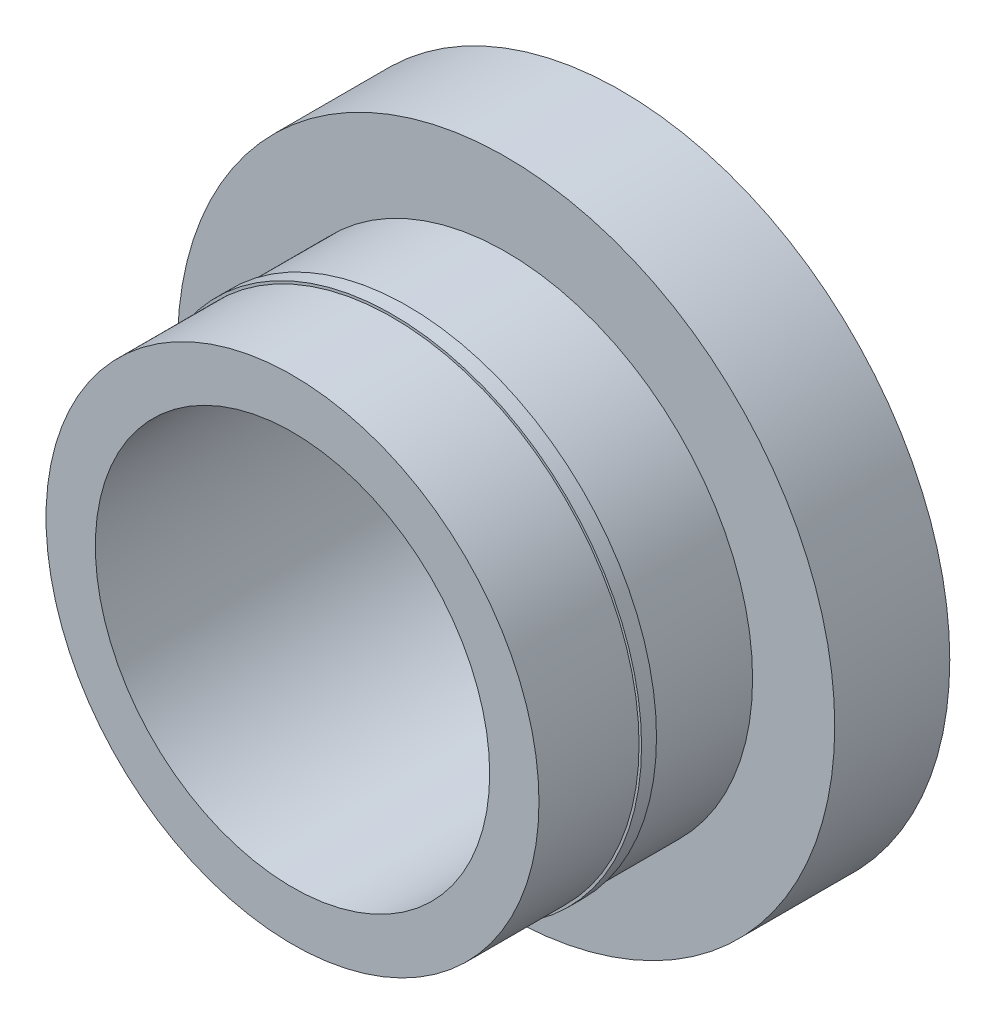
ISO-10303-21;
HEADER;
FILE_DESCRIPTION(('STEP AP214'),'2;1');
FILE_NAME('part.step','',(''),(''),'','','');
FILE_SCHEMA(('AUTOMOTIVE_DESIGN { 1 0 10303 214 1 1 1 1 }'));
ENDSEC;
DATA;
#1=APPLICATION_CONTEXT('core data for automotive mechanical design processes');
#2=APPLICATION_PROTOCOL_DEFINITION('international standard','automotive_design',2000,#1);
#3=PRODUCT_CONTEXT('',#1,'mechanical');
#4=PRODUCT('Part','Part','',(#3));
#5=PRODUCT_RELATED_PRODUCT_CATEGORY('part','',(#4));
#6=PRODUCT_DEFINITION_FORMATION('','',#4);
#7=PRODUCT_DEFINITION_CONTEXT('part definition',#1,'design');
#8=PRODUCT_DEFINITION('design','',#6,#7);
#9=PRODUCT_DEFINITION_SHAPE('','',#8);
#10=(LENGTH_UNIT() NAMED_UNIT(*) SI_UNIT(.MILLI.,.METRE.));
#11=(NAMED_UNIT(*) PLANE_ANGLE_UNIT() SI_UNIT($,.RADIAN.));
#12=(NAMED_UNIT(*) SI_UNIT($,.STERADIAN.) SOLID_ANGLE_UNIT());
#13=UNCERTAINTY_MEASURE_WITH_UNIT(LENGTH_MEASURE(1.E-05),#10,'distance_accuracy_value','');
#14=(GEOMETRIC_REPRESENTATION_CONTEXT(3) GLOBAL_UNCERTAINTY_ASSIGNED_CONTEXT((#13)) GLOBAL_UNIT_ASSIGNED_CONTEXT((#10,
#11,#12)) REPRESENTATION_CONTEXT('',''));
#15=CARTESIAN_POINT('',(0.,0.,0.));
#16=DIRECTION('',(0.,0.,1.));
#17=DIRECTION('',(1.,0.,0.));
#18=AXIS2_PLACEMENT_3D('',#15,#16,#17);
#19=CARTESIAN_POINT('',(180.571520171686,203.348814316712,198.922008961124));
#20=DIRECTION('',(0.,0.,-1.));
#21=DIRECTION('',(1.,0.,0.));
#22=AXIS2_PLACEMENT_3D('',#19,#20,#21);
#23=CYLINDRICAL_SURFACE('',#22,7.50000000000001);
#24=CARTESIAN_POINT('',(180.571520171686,203.348814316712,222.724362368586));
#25=DIRECTION('',(0.,0.,1.));
#26=DIRECTION('',(1.,0.,0.));
#27=AXIS2_PLACEMENT_3D('',#24,#25,#26);
#28=CIRCLE('',#27,7.50000000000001);
#29=CARTESIAN_POINT('',(188.071520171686,203.348814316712,222.724362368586));
#30=VERTEX_POINT('',#29);
#31=EDGE_CURVE('E71',#30,#30,#28,.T.);
#32=ORIENTED_EDGE('',*,*,#31,.F.);
#33=EDGE_LOOP('',(#32));
#34=FACE_BOUND('',#33,.T.);
#35=CARTESIAN_POINT('',(180.571520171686,203.348814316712,219.679241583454));
#36=DIRECTION('',(0.,0.,1.));
#37=DIRECTION('',(1.,0.,0.));
#38=AXIS2_PLACEMENT_3D('',#35,#36,#37);
#39=CIRCLE('',#38,7.50000000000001);
#40=CARTESIAN_POINT('',(188.071520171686,203.348814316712,219.679241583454));
#41=VERTEX_POINT('',#40);
#42=EDGE_CURVE('E10',#41,#41,#39,.T.);
#43=ORIENTED_EDGE('',*,*,#42,.T.);
#44=EDGE_LOOP('',(#43));
#45=FACE_BOUND('',#44,.T.);
#46=ADVANCED_FACE('F37',(#34,#45),#23,.T.);
#47=CARTESIAN_POINT('',(180.571520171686,175.348814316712,219.679241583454));
#48=DIRECTION('',(0.,0.,1.));
#49=DIRECTION('',(-1.,0.,0.));
#50=AXIS2_PLACEMENT_3D('',#47,#48,#49);
#51=PLANE('',#50);
#52=ORIENTED_EDGE('',*,*,#42,.F.);
#53=EDGE_LOOP('',(#52));
#54=FACE_BOUND('',#53,.T.);
#55=CARTESIAN_POINT('',(180.571520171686,203.348814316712,219.679241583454));
#56=DIRECTION('',(0.,0.,1.));
#57=DIRECTION('',(1.,0.,0.));
#58=AXIS2_PLACEMENT_3D('',#55,#56,#57);
#59=CIRCLE('',#58,7.57599598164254);
#60=CARTESIAN_POINT('',(188.147516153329,203.348814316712,219.679241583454));
#61=VERTEX_POINT('',#60);
#62=EDGE_CURVE('E43',#61,#61,#59,.T.);
#63=ORIENTED_EDGE('',*,*,#62,.T.);
#64=EDGE_LOOP('',(#63));
#65=FACE_BOUND('',#64,.T.);
#66=ADVANCED_FACE('F78',(#54,#65),#51,.T.);
#67=CARTESIAN_POINT('',(180.571520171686,203.348814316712,198.922008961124));
#68=DIRECTION('',(0.,0.,-1.));
#69=DIRECTION('',(1.,0.,0.));
#70=AXIS2_PLACEMENT_3D('',#67,#68,#69);
#71=CYLINDRICAL_SURFACE('',#70,7.57599598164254);
#72=ORIENTED_EDGE('',*,*,#62,.F.);
#73=EDGE_LOOP('',(#72));
#74=FACE_BOUND('',#73,.T.);
#75=CARTESIAN_POINT('',(180.571520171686,203.348814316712,219.224362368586));
#76=DIRECTION('',(0.,0.,1.));
#77=DIRECTION('',(1.,0.,0.));
#78=AXIS2_PLACEMENT_3D('',#75,#76,#77);
#79=CIRCLE('',#78,7.57599598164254);
#80=CARTESIAN_POINT('',(188.147516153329,203.348814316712,219.224362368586));
#81=VERTEX_POINT('',#80);
#82=EDGE_CURVE('E47',#81,#81,#79,.T.);
#83=ORIENTED_EDGE('',*,*,#82,.T.);
#84=EDGE_LOOP('',(#83));
#85=FACE_BOUND('',#84,.T.);
#86=ADVANCED_FACE('F82',(#74,#85),#71,.T.);
#87=CARTESIAN_POINT('',(180.571520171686,175.348814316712,219.224362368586));
#88=DIRECTION('',(0.,0.,1.));
#89=DIRECTION('',(-1.,0.,0.));
#90=AXIS2_PLACEMENT_3D('',#87,#88,#89);
#91=PLANE('',#90);
#92=CARTESIAN_POINT('',(180.571520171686,203.348814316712,219.224362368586));
#93=DIRECTION('',(0.,0.,1.));
#94=DIRECTION('',(1.,0.,0.));
#95=AXIS2_PLACEMENT_3D('',#92,#93,#94);
#96=CIRCLE('',#95,7.50000000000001);
#97=CARTESIAN_POINT('',(188.071520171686,203.348814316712,219.224362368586));
#98=VERTEX_POINT('',#97);
#99=EDGE_CURVE('E51',#98,#98,#96,.T.);
#100=ORIENTED_EDGE('',*,*,#99,.T.);
#101=EDGE_LOOP('',(#100));
#102=FACE_BOUND('',#101,.T.);
#103=ORIENTED_EDGE('',*,*,#82,.F.);
#104=EDGE_LOOP('',(#103));
#105=FACE_BOUND('',#104,.T.);
#106=ADVANCED_FACE('F87',(#102,#105),#91,.F.);
#107=CARTESIAN_POINT('',(180.571520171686,203.348814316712,198.922008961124));
#108=DIRECTION('',(0.,0.,-1.));
#109=DIRECTION('',(1.,0.,0.));
#110=AXIS2_PLACEMENT_3D('',#107,#108,#109);
#111=CYLINDRICAL_SURFACE('',#110,7.50000000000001);
#112=CARTESIAN_POINT('',(180.571520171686,203.348814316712,216.224362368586));
#113=DIRECTION('',(0.,0.,1.));
#114=DIRECTION('',(1.,0.,0.));
#115=AXIS2_PLACEMENT_3D('',#112,#113,#114);
#116=CIRCLE('',#115,7.50000000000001);
#117=CARTESIAN_POINT('',(188.071520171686,203.348814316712,216.224362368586));
#118=VERTEX_POINT('',#117);
#119=EDGE_CURVE('E56',#118,#118,#116,.T.);
#120=ORIENTED_EDGE('',*,*,#119,.T.);
#121=EDGE_LOOP('',(#120));
#122=FACE_BOUND('',#121,.T.);
#123=ORIENTED_EDGE('',*,*,#99,.F.);
#124=EDGE_LOOP('',(#123));
#125=FACE_BOUND('',#124,.T.);
#126=ADVANCED_FACE('F93',(#122,#125),#111,.T.);
#127=CARTESIAN_POINT('',(180.571520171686,175.348814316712,216.224362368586));
#128=DIRECTION('',(0.,0.,-1.));
#129=DIRECTION('',(1.,0.,0.));
#130=AXIS2_PLACEMENT_3D('',#127,#128,#129);
#131=PLANE('',#130);
#132=CARTESIAN_POINT('',(180.571520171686,203.348814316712,216.224362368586));
#133=DIRECTION('',(0.,0.,1.));
#134=DIRECTION('',(1.,0.,0.));
#135=AXIS2_PLACEMENT_3D('',#132,#133,#134);
#136=CIRCLE('',#135,10.);
#137=CARTESIAN_POINT('',(190.571520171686,203.348814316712,216.224362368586));
#138=VERTEX_POINT('',#137);
#139=EDGE_CURVE('E59',#138,#138,#136,.T.);
#140=ORIENTED_EDGE('',*,*,#139,.T.);
#141=EDGE_LOOP('',(#140));
#142=FACE_BOUND('',#141,.T.);
#143=ORIENTED_EDGE('',*,*,#119,.F.);
#144=EDGE_LOOP('',(#143));
#145=FACE_BOUND('',#144,.T.);
#146=ADVANCED_FACE('F97',(#142,#145),#131,.F.);
#147=CARTESIAN_POINT('',(180.571520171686,203.348814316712,198.922008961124));
#148=DIRECTION('',(0.,0.,-1.));
#149=DIRECTION('',(1.,0.,0.));
#150=AXIS2_PLACEMENT_3D('',#147,#148,#149);
#151=CYLINDRICAL_SURFACE('',#150,10.);
#152=ORIENTED_EDGE('',*,*,#139,.F.);
#153=EDGE_LOOP('',(#152));
#154=FACE_BOUND('',#153,.T.);
#155=CARTESIAN_POINT('',(180.571520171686,203.348814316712,212.724362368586));
#156=DIRECTION('',(0.,0.,1.));
#157=DIRECTION('',(1.,0.,0.));
#158=AXIS2_PLACEMENT_3D('',#155,#156,#157);
#159=CIRCLE('',#158,10.);
#160=CARTESIAN_POINT('',(190.571520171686,203.348814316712,212.724362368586));
#161=VERTEX_POINT('',#160);
#162=EDGE_CURVE('E62',#161,#161,#159,.T.);
#163=ORIENTED_EDGE('',*,*,#162,.T.);
#164=EDGE_LOOP('',(#163));
#165=FACE_BOUND('',#164,.T.);
#166=ADVANCED_FACE('F101',(#154,#165),#151,.T.);
#167=CARTESIAN_POINT('',(180.571520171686,175.348814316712,212.724362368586));
#168=DIRECTION('',(0.,0.,-1.));
#169=DIRECTION('',(1.,0.,0.));
#170=AXIS2_PLACEMENT_3D('',#167,#168,#169);
#171=PLANE('',#170);
#172=ORIENTED_EDGE('',*,*,#162,.F.);
#173=EDGE_LOOP('',(#172));
#174=FACE_BOUND('',#173,.T.);
#175=CARTESIAN_POINT('',(180.571520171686,203.348814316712,212.724362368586));
#176=DIRECTION('',(0.,0.,1.));
#177=DIRECTION('',(1.,0.,0.));
#178=AXIS2_PLACEMENT_3D('',#175,#176,#177);
#179=CIRCLE('',#178,6.);
#180=CARTESIAN_POINT('',(186.571520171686,203.348814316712,212.724362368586));
#181=VERTEX_POINT('',#180);
#182=EDGE_CURVE('E65',#181,#181,#179,.T.);
#183=ORIENTED_EDGE('',*,*,#182,.T.);
#184=EDGE_LOOP('',(#183));
#185=FACE_BOUND('',#184,.T.);
#186=ADVANCED_FACE('F105',(#174,#185),#171,.T.);
#187=CARTESIAN_POINT('',(180.571520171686,203.348814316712,198.922008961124));
#188=DIRECTION('',(0.,0.,-1.));
#189=DIRECTION('',(1.,0.,0.));
#190=AXIS2_PLACEMENT_3D('',#187,#188,#189);
#191=CYLINDRICAL_SURFACE('',#190,6.);
#192=ORIENTED_EDGE('',*,*,#182,.F.);
#193=EDGE_LOOP('',(#192));
#194=FACE_BOUND('',#193,.T.);
#195=CARTESIAN_POINT('',(180.571520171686,203.348814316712,222.724362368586));
#196=DIRECTION('',(0.,0.,1.));
#197=DIRECTION('',(1.,0.,0.));
#198=AXIS2_PLACEMENT_3D('',#195,#196,#197);
#199=CIRCLE('',#198,6.);
#200=CARTESIAN_POINT('',(186.571520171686,203.348814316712,222.724362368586));
#201=VERTEX_POINT('',#200);
#202=EDGE_CURVE('E68',#201,#201,#199,.T.);
#203=ORIENTED_EDGE('',*,*,#202,.T.);
#204=EDGE_LOOP('',(#203));
#205=FACE_BOUND('',#204,.T.);
#206=ADVANCED_FACE('F109',(#194,#205),#191,.F.);
#207=CARTESIAN_POINT('',(180.571520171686,175.348814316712,222.724362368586));
#208=DIRECTION('',(0.,0.,1.));
#209=DIRECTION('',(-1.,0.,0.));
#210=AXIS2_PLACEMENT_3D('',#207,#208,#209);
#211=PLANE('',#210);
#212=ORIENTED_EDGE('',*,*,#202,.F.);
#213=EDGE_LOOP('',(#212));
#214=FACE_BOUND('',#213,.T.);
#215=ORIENTED_EDGE('',*,*,#31,.T.);
#216=EDGE_LOOP('',(#215));
#217=FACE_BOUND('',#216,.T.);
#218=ADVANCED_FACE('F75',(#214,#217),#211,.T.);
#219=CLOSED_SHELL('',(#46,#66,#86,#106,#126,#146,#166,#186,#206,#218));
#220=MANIFOLD_SOLID_BREP('B2',#219);
#221=ADVANCED_BREP_SHAPE_REPRESENTATION('',(#18,#220),#14);
#222=SHAPE_DEFINITION_REPRESENTATION(#9,#221);
ENDSEC;
END-ISO-10303-21;
